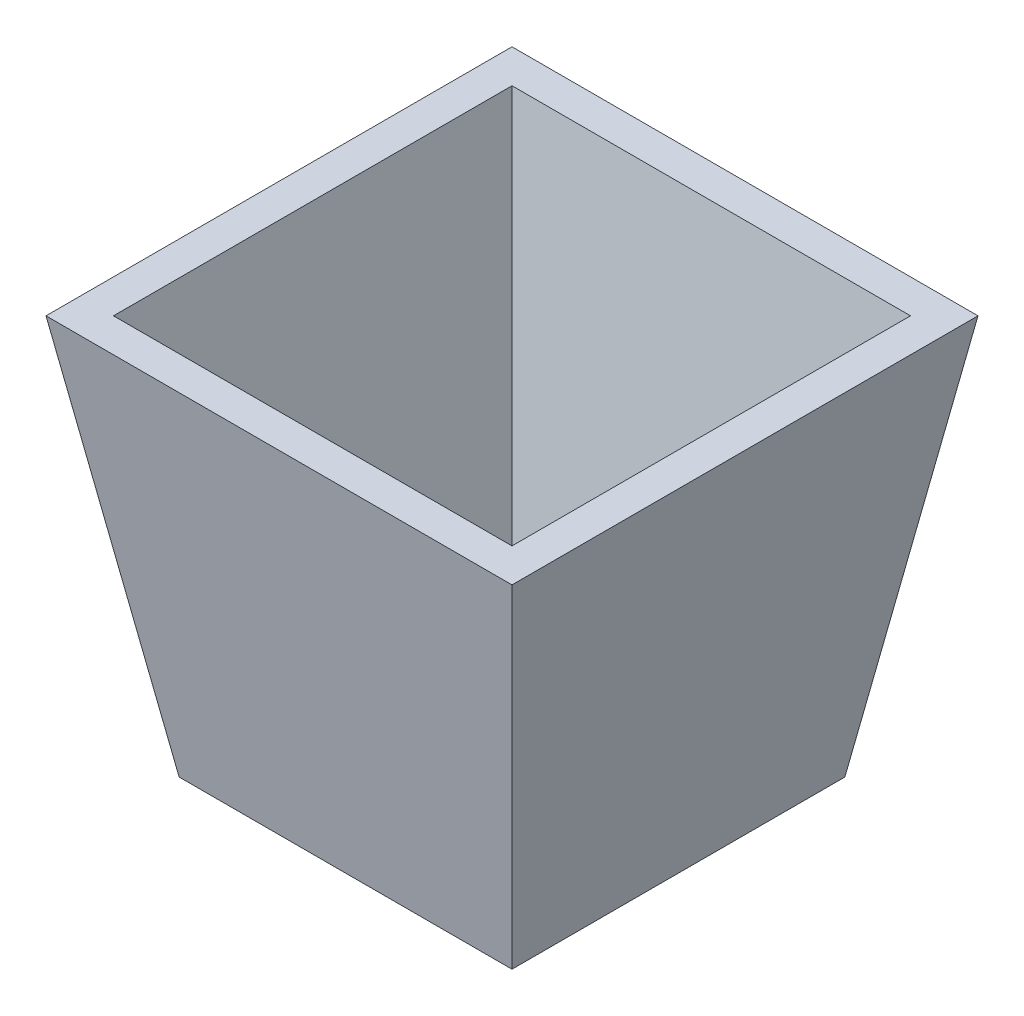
ISO-10303-21;
HEADER;
FILE_DESCRIPTION(('STEP AP214'),'2;1');
FILE_NAME('part.step','',(''),(''),'','','');
FILE_SCHEMA(('AUTOMOTIVE_DESIGN { 1 0 10303 214 1 1 1 1 }'));
ENDSEC;
DATA;
#1=APPLICATION_CONTEXT('core data for automotive mechanical design processes');
#2=APPLICATION_PROTOCOL_DEFINITION('international standard','automotive_design',2000,#1);
#3=PRODUCT_CONTEXT('',#1,'mechanical');
#4=PRODUCT('Part','Part','',(#3));
#5=PRODUCT_RELATED_PRODUCT_CATEGORY('part','',(#4));
#6=PRODUCT_DEFINITION_FORMATION('','',#4);
#7=PRODUCT_DEFINITION_CONTEXT('part definition',#1,'design');
#8=PRODUCT_DEFINITION('design','',#6,#7);
#9=PRODUCT_DEFINITION_SHAPE('','',#8);
#10=(LENGTH_UNIT() NAMED_UNIT(*) SI_UNIT(.MILLI.,.METRE.));
#11=(NAMED_UNIT(*) PLANE_ANGLE_UNIT() SI_UNIT($,.RADIAN.));
#12=(NAMED_UNIT(*) SI_UNIT($,.STERADIAN.) SOLID_ANGLE_UNIT());
#13=UNCERTAINTY_MEASURE_WITH_UNIT(LENGTH_MEASURE(1.E-05),#10,'distance_accuracy_value','');
#14=(GEOMETRIC_REPRESENTATION_CONTEXT(3) GLOBAL_UNCERTAINTY_ASSIGNED_CONTEXT((#13)) GLOBAL_UNIT_ASSIGNED_CONTEXT((#10,
#11,#12)) REPRESENTATION_CONTEXT('',''));
#15=CARTESIAN_POINT('',(0.,0.,0.));
#16=DIRECTION('',(0.,0.,1.));
#17=DIRECTION('',(1.,0.,0.));
#18=AXIS2_PLACEMENT_3D('',#15,#16,#17);
#19=CARTESIAN_POINT('',(0.,0.,0.));
#20=DIRECTION('',(0.,1.,0.));
#21=DIRECTION('',(0.,0.,1.));
#22=AXIS2_PLACEMENT_3D('',#19,#20,#21);
#23=PLANE('',#22);
#24=DIRECTION('',(1.,0.,0.));
#25=VECTOR('',#24,1.);
#26=CARTESIAN_POINT('',(0.,0.,41.5287291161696));
#27=LINE('',#26,#25);
#28=CARTESIAN_POINT('',(-41.5287291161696,0.,41.5287291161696));
#29=VERTEX_POINT('',#28);
#30=CARTESIAN_POINT('',(41.5287291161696,0.,41.5287291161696));
#31=VERTEX_POINT('',#30);
#32=EDGE_CURVE('E131',#29,#31,#27,.T.);
#33=ORIENTED_EDGE('',*,*,#32,.T.);
#34=DIRECTION('',(0.,0.,-1.));
#35=VECTOR('',#34,1.);
#36=CARTESIAN_POINT('',(41.5287291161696,0.,0.));
#37=LINE('',#36,#35);
#38=CARTESIAN_POINT('',(41.5287291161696,0.,-41.5287291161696));
#39=VERTEX_POINT('',#38);
#40=EDGE_CURVE('E157',#31,#39,#37,.T.);
#41=ORIENTED_EDGE('',*,*,#40,.T.);
#42=DIRECTION('',(-1.,0.,0.));
#43=VECTOR('',#42,1.);
#44=CARTESIAN_POINT('',(0.,0.,-41.5287291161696));
#45=LINE('',#44,#43);
#46=CARTESIAN_POINT('',(-41.5287291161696,0.,-41.5287291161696));
#47=VERTEX_POINT('',#46);
#48=EDGE_CURVE('E140',#39,#47,#45,.T.);
#49=ORIENTED_EDGE('',*,*,#48,.T.);
#50=DIRECTION('',(0.,0.,1.));
#51=VECTOR('',#50,1.);
#52=CARTESIAN_POINT('',(-41.5287291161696,0.,0.));
#53=LINE('',#52,#51);
#54=EDGE_CURVE('E141',#47,#29,#53,.T.);
#55=ORIENTED_EDGE('',*,*,#54,.T.);
#56=EDGE_LOOP('',(#33,#41,#49,#55));
#57=FACE_BOUND('',#56,.T.);
#58=DIRECTION('',(0.,0.,-1.));
#59=VECTOR('',#58,1.);
#60=CARTESIAN_POINT('',(50.,0.,-50.));
#61=LINE('',#60,#59);
#62=CARTESIAN_POINT('',(50.,0.,50.));
#63=VERTEX_POINT('',#62);
#64=CARTESIAN_POINT('',(50.,0.,-50.));
#65=VERTEX_POINT('',#64);
#66=EDGE_CURVE('E231',#63,#65,#61,.T.);
#67=ORIENTED_EDGE('',*,*,#66,.F.);
#68=DIRECTION('',(1.,0.,0.));
#69=VECTOR('',#68,1.);
#70=CARTESIAN_POINT('',(-50.,0.,50.));
#71=LINE('',#70,#69);
#72=CARTESIAN_POINT('',(-50.,0.,50.));
#73=VERTEX_POINT('',#72);
#74=EDGE_CURVE('E245',#73,#63,#71,.T.);
#75=ORIENTED_EDGE('',*,*,#74,.F.);
#76=DIRECTION('',(0.,0.,1.));
#77=VECTOR('',#76,1.);
#78=CARTESIAN_POINT('',(-50.,0.,-50.));
#79=LINE('',#78,#77);
#80=CARTESIAN_POINT('',(-50.,0.,-50.));
#81=VERTEX_POINT('',#80);
#82=EDGE_CURVE('E59',#81,#73,#79,.T.);
#83=ORIENTED_EDGE('',*,*,#82,.F.);
#84=DIRECTION('',(-1.,0.,0.));
#85=VECTOR('',#84,1.);
#86=CARTESIAN_POINT('',(-50.,0.,-50.));
#87=LINE('',#86,#85);
#88=EDGE_CURVE('E12',#65,#81,#87,.T.);
#89=ORIENTED_EDGE('',*,*,#88,.F.);
#90=EDGE_LOOP('',(#67,#75,#83,#89));
#91=FACE_BOUND('',#90,.T.);
#92=ADVANCED_FACE('F49',(#57,#91),#23,.F.);
#93=CARTESIAN_POINT('',(0.,120.,0.));
#94=DIRECTION('',(0.,1.,0.));
#95=DIRECTION('',(0.,0.,1.));
#96=AXIS2_PLACEMENT_3D('',#93,#94,#95);
#97=PLANE('',#96);
#98=DIRECTION('',(0.,0.,-1.));
#99=VECTOR('',#98,1.);
#100=CARTESIAN_POINT('',(59.862062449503,120.,0.));
#101=LINE('',#100,#99);
#102=CARTESIAN_POINT('',(59.862062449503,120.,59.862062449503));
#103=VERTEX_POINT('',#102);
#104=CARTESIAN_POINT('',(59.862062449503,120.,-59.862062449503));
#105=VERTEX_POINT('',#104);
#106=EDGE_CURVE('E159',#103,#105,#101,.T.);
#107=ORIENTED_EDGE('',*,*,#106,.F.);
#108=DIRECTION('',(1.,0.,0.));
#109=VECTOR('',#108,1.);
#110=CARTESIAN_POINT('',(0.,120.,59.862062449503));
#111=LINE('',#110,#109);
#112=CARTESIAN_POINT('',(-59.862062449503,120.,59.862062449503));
#113=VERTEX_POINT('',#112);
#114=EDGE_CURVE('E181',#113,#103,#111,.T.);
#115=ORIENTED_EDGE('',*,*,#114,.F.);
#116=DIRECTION('',(0.,0.,1.));
#117=VECTOR('',#116,1.);
#118=CARTESIAN_POINT('',(-59.862062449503,120.,0.));
#119=LINE('',#118,#117);
#120=CARTESIAN_POINT('',(-59.862062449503,120.,-59.862062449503));
#121=VERTEX_POINT('',#120);
#122=EDGE_CURVE('E183',#121,#113,#119,.T.);
#123=ORIENTED_EDGE('',*,*,#122,.F.);
#124=DIRECTION('',(-1.,0.,0.));
#125=VECTOR('',#124,1.);
#126=CARTESIAN_POINT('',(0.,120.,-59.862062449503));
#127=LINE('',#126,#125);
#128=EDGE_CURVE('E173',#105,#121,#127,.T.);
#129=ORIENTED_EDGE('',*,*,#128,.F.);
#130=EDGE_LOOP('',(#107,#115,#123,#129));
#131=FACE_BOUND('',#130,.T.);
#132=DIRECTION('',(0.,0.,-1.));
#133=VECTOR('',#132,1.);
#134=CARTESIAN_POINT('',(70.,120.,-70.));
#135=LINE('',#134,#133);
#136=CARTESIAN_POINT('',(70.,120.,70.));
#137=VERTEX_POINT('',#136);
#138=CARTESIAN_POINT('',(70.,120.,-70.));
#139=VERTEX_POINT('',#138);
#140=EDGE_CURVE('E168',#137,#139,#135,.T.);
#141=ORIENTED_EDGE('',*,*,#140,.T.);
#142=DIRECTION('',(-1.,0.,0.));
#143=VECTOR('',#142,1.);
#144=CARTESIAN_POINT('',(-70.,120.,-70.));
#145=LINE('',#144,#143);
#146=CARTESIAN_POINT('',(-70.,120.,-70.));
#147=VERTEX_POINT('',#146);
#148=EDGE_CURVE('E191',#139,#147,#145,.T.);
#149=ORIENTED_EDGE('',*,*,#148,.T.);
#150=DIRECTION('',(0.,0.,1.));
#151=VECTOR('',#150,1.);
#152=CARTESIAN_POINT('',(-70.,120.,-70.));
#153=LINE('',#152,#151);
#154=CARTESIAN_POINT('',(-70.,120.,70.));
#155=VERTEX_POINT('',#154);
#156=EDGE_CURVE('E283',#147,#155,#153,.T.);
#157=ORIENTED_EDGE('',*,*,#156,.T.);
#158=DIRECTION('',(1.,0.,0.));
#159=VECTOR('',#158,1.);
#160=CARTESIAN_POINT('',(-70.,120.,70.));
#161=LINE('',#160,#159);
#162=EDGE_CURVE('E299',#155,#137,#161,.T.);
#163=ORIENTED_EDGE('',*,*,#162,.T.);
#164=EDGE_LOOP('',(#141,#149,#157,#163));
#165=FACE_BOUND('',#164,.T.);
#166=ADVANCED_FACE('F345',(#131,#165),#97,.T.);
#167=CARTESIAN_POINT('',(48.6486486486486,-8.10810810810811,0.));
#168=DIRECTION('',(0.986393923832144,-0.164398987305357,0.));
#169=DIRECTION('',(0.164398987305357,0.986393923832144,0.));
#170=AXIS2_PLACEMENT_3D('',#167,#168,#169);
#171=PLANE('',#170);
#172=DIRECTION('',(-0.162221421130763,-0.973328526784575,-0.162221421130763));
#173=VECTOR('',#172,1.);
#174=CARTESIAN_POINT('',(70.,120.,70.));
#175=LINE('',#174,#173);
#176=EDGE_CURVE('E302',#137,#63,#175,.T.);
#177=ORIENTED_EDGE('',*,*,#176,.T.);
#178=ORIENTED_EDGE('',*,*,#66,.T.);
#179=DIRECTION('',(-0.162221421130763,-0.973328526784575,0.162221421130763));
#180=VECTOR('',#179,1.);
#181=CARTESIAN_POINT('',(70.,120.,-70.));
#182=LINE('',#181,#180);
#183=EDGE_CURVE('E197',#139,#65,#182,.T.);
#184=ORIENTED_EDGE('',*,*,#183,.F.);
#185=ORIENTED_EDGE('',*,*,#140,.F.);
#186=EDGE_LOOP('',(#177,#178,#184,#185));
#187=FACE_BOUND('',#186,.T.);
#188=ADVANCED_FACE('F210',(#187),#171,.T.);
#189=CARTESIAN_POINT('',(0.,-8.10810810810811,-48.6486486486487));
#190=DIRECTION('',(0.,-0.164398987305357,-0.986393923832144));
#191=DIRECTION('',(0.,0.986393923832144,-0.164398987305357));
#192=AXIS2_PLACEMENT_3D('',#189,#190,#191);
#193=PLANE('',#192);
#194=ORIENTED_EDGE('',*,*,#183,.T.);
#195=ORIENTED_EDGE('',*,*,#88,.T.);
#196=DIRECTION('',(0.162221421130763,-0.973328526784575,0.162221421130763));
#197=VECTOR('',#196,1.);
#198=CARTESIAN_POINT('',(-70.,120.,-70.));
#199=LINE('',#198,#197);
#200=EDGE_CURVE('E288',#147,#81,#199,.T.);
#201=ORIENTED_EDGE('',*,*,#200,.F.);
#202=ORIENTED_EDGE('',*,*,#148,.F.);
#203=EDGE_LOOP('',(#194,#195,#201,#202));
#204=FACE_BOUND('',#203,.T.);
#205=ADVANCED_FACE('F199',(#204),#193,.T.);
#206=CARTESIAN_POINT('',(0.,-8.10810810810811,48.6486486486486));
#207=DIRECTION('',(0.,-0.164398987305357,0.986393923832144));
#208=DIRECTION('',(0.,-0.986393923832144,-0.164398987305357));
#209=AXIS2_PLACEMENT_3D('',#206,#207,#208);
#210=PLANE('',#209);
#211=DIRECTION('',(0.162221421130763,-0.973328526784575,-0.162221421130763));
#212=VECTOR('',#211,1.);
#213=CARTESIAN_POINT('',(-70.,120.,70.));
#214=LINE('',#213,#212);
#215=EDGE_CURVE('E286',#155,#73,#214,.T.);
#216=ORIENTED_EDGE('',*,*,#215,.T.);
#217=ORIENTED_EDGE('',*,*,#74,.T.);
#218=ORIENTED_EDGE('',*,*,#176,.F.);
#219=ORIENTED_EDGE('',*,*,#162,.F.);
#220=EDGE_LOOP('',(#216,#217,#218,#219));
#221=FACE_BOUND('',#220,.T.);
#222=ADVANCED_FACE('F209',(#221),#210,.T.);
#223=CARTESIAN_POINT('',(-48.6486486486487,-8.10810810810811,0.));
#224=DIRECTION('',(-0.986393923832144,-0.164398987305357,0.));
#225=DIRECTION('',(0.164398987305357,-0.986393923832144,0.));
#226=AXIS2_PLACEMENT_3D('',#223,#224,#225);
#227=PLANE('',#226);
#228=ORIENTED_EDGE('',*,*,#200,.T.);
#229=ORIENTED_EDGE('',*,*,#82,.T.);
#230=ORIENTED_EDGE('',*,*,#215,.F.);
#231=ORIENTED_EDGE('',*,*,#156,.F.);
#232=EDGE_LOOP('',(#228,#229,#230,#231));
#233=FACE_BOUND('',#232,.T.);
#234=ADVANCED_FACE('F263',(#233),#227,.T.);
#235=CARTESIAN_POINT('',(38.7847094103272,-6.46411823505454,0.));
#236=DIRECTION('',(0.986393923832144,-0.164398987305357,0.));
#237=DIRECTION('',(0.164398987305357,0.986393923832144,0.));
#238=AXIS2_PLACEMENT_3D('',#235,#236,#237);
#239=PLANE('',#238);
#240=DIRECTION('',(-0.162221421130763,-0.973328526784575,-0.162221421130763));
#241=VECTOR('',#240,1.);
#242=CARTESIAN_POINT('',(37.764059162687,-12.5880197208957,37.764059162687));
#243=LINE('',#242,#241);
#244=CARTESIAN_POINT('',(41.5287291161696,10.,41.5287291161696));
#245=VERTEX_POINT('',#244);
#246=EDGE_CURVE('E169',#103,#245,#243,.T.);
#247=ORIENTED_EDGE('',*,*,#246,.F.);
#248=ORIENTED_EDGE('',*,*,#106,.T.);
#249=DIRECTION('',(-0.162221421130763,-0.973328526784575,0.162221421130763));
#250=VECTOR('',#249,1.);
#251=CARTESIAN_POINT('',(37.764059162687,-12.5880197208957,-37.764059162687));
#252=LINE('',#251,#250);
#253=CARTESIAN_POINT('',(41.5287291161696,9.99999999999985,-41.5287291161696));
#254=VERTEX_POINT('',#253);
#255=EDGE_CURVE('E172',#105,#254,#252,.T.);
#256=ORIENTED_EDGE('',*,*,#255,.T.);
#257=DIRECTION('',(0.,0.,-1.));
#258=VECTOR('',#257,1.);
#259=CARTESIAN_POINT('',(41.5287291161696,10.,0.));
#260=LINE('',#259,#258);
#261=EDGE_CURVE('E160',#245,#254,#260,.T.);
#262=ORIENTED_EDGE('',*,*,#261,.F.);
#263=EDGE_LOOP('',(#247,#248,#256,#262));
#264=FACE_BOUND('',#263,.T.);
#265=ADVANCED_FACE('F271',(#264),#239,.F.);
#266=CARTESIAN_POINT('',(0.,-6.46411823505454,-38.7847094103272));
#267=DIRECTION('',(0.,-0.164398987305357,-0.986393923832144));
#268=DIRECTION('',(0.,0.986393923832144,-0.164398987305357));
#269=AXIS2_PLACEMENT_3D('',#266,#267,#268);
#270=PLANE('',#269);
#271=ORIENTED_EDGE('',*,*,#255,.F.);
#272=ORIENTED_EDGE('',*,*,#128,.T.);
#273=DIRECTION('',(0.162221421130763,-0.973328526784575,0.162221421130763));
#274=VECTOR('',#273,1.);
#275=CARTESIAN_POINT('',(-37.764059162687,-12.5880197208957,-37.764059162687));
#276=LINE('',#275,#274);
#277=CARTESIAN_POINT('',(-41.5287291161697,10.,-41.5287291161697));
#278=VERTEX_POINT('',#277);
#279=EDGE_CURVE('E163',#121,#278,#276,.T.);
#280=ORIENTED_EDGE('',*,*,#279,.T.);
#281=DIRECTION('',(-1.,0.,0.));
#282=VECTOR('',#281,1.);
#283=CARTESIAN_POINT('',(0.,10.,-41.5287291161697));
#284=LINE('',#283,#282);
#285=EDGE_CURVE('E166',#254,#278,#284,.T.);
#286=ORIENTED_EDGE('',*,*,#285,.F.);
#287=EDGE_LOOP('',(#271,#272,#280,#286));
#288=FACE_BOUND('',#287,.T.);
#289=ADVANCED_FACE('F362',(#288),#270,.F.);
#290=CARTESIAN_POINT('',(0.,-6.46411823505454,38.7847094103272));
#291=DIRECTION('',(0.,-0.164398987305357,0.986393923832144));
#292=DIRECTION('',(0.,-0.986393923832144,-0.164398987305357));
#293=AXIS2_PLACEMENT_3D('',#290,#291,#292);
#294=PLANE('',#293);
#295=DIRECTION('',(0.162221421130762,-0.973328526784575,-0.162221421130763));
#296=VECTOR('',#295,1.);
#297=CARTESIAN_POINT('',(-37.764059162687,-12.5880197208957,37.764059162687));
#298=LINE('',#297,#296);
#299=CARTESIAN_POINT('',(-41.5287291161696,9.99999999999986,41.5287291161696));
#300=VERTEX_POINT('',#299);
#301=EDGE_CURVE('E75',#113,#300,#298,.T.);
#302=ORIENTED_EDGE('',*,*,#301,.F.);
#303=ORIENTED_EDGE('',*,*,#114,.T.);
#304=ORIENTED_EDGE('',*,*,#246,.T.);
#305=DIRECTION('',(1.,0.,0.));
#306=VECTOR('',#305,1.);
#307=CARTESIAN_POINT('',(0.,10.,41.5287291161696));
#308=LINE('',#307,#306);
#309=EDGE_CURVE('E162',#300,#245,#308,.T.);
#310=ORIENTED_EDGE('',*,*,#309,.F.);
#311=EDGE_LOOP('',(#302,#303,#304,#310));
#312=FACE_BOUND('',#311,.T.);
#313=ADVANCED_FACE('F372',(#312),#294,.F.);
#314=CARTESIAN_POINT('',(-38.7847094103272,-6.46411823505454,0.));
#315=DIRECTION('',(-0.986393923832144,-0.164398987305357,0.));
#316=DIRECTION('',(0.164398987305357,-0.986393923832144,0.));
#317=AXIS2_PLACEMENT_3D('',#314,#315,#316);
#318=PLANE('',#317);
#319=ORIENTED_EDGE('',*,*,#279,.F.);
#320=ORIENTED_EDGE('',*,*,#122,.T.);
#321=ORIENTED_EDGE('',*,*,#301,.T.);
#322=DIRECTION('',(0.,0.,1.));
#323=VECTOR('',#322,1.);
#324=CARTESIAN_POINT('',(-41.5287291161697,10.,0.));
#325=LINE('',#324,#323);
#326=EDGE_CURVE('E147',#278,#300,#325,.T.);
#327=ORIENTED_EDGE('',*,*,#326,.F.);
#328=EDGE_LOOP('',(#319,#320,#321,#327));
#329=FACE_BOUND('',#328,.T.);
#330=ADVANCED_FACE('F381',(#329),#318,.F.);
#331=CARTESIAN_POINT('',(41.5287291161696,-9.99999999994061E-05,-41.5287291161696));
#332=DIRECTION('',(1.,0.,0.));
#333=DIRECTION('',(0.,0.,-1.));
#334=AXIS2_PLACEMENT_3D('',#331,#332,#333);
#335=PLANE('',#334);
#336=DIRECTION('',(0.,1.,0.));
#337=VECTOR('',#336,1.);
#338=CARTESIAN_POINT('',(41.5287291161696,-9.99999999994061E-05,41.5287291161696));
#339=LINE('',#338,#337);
#340=EDGE_CURVE('E136',#31,#245,#339,.T.);
#341=ORIENTED_EDGE('',*,*,#340,.T.);
#342=ORIENTED_EDGE('',*,*,#261,.T.);
#343=DIRECTION('',(0.,1.,0.));
#344=VECTOR('',#343,1.);
#345=CARTESIAN_POINT('',(41.5287291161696,-9.99999999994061E-05,-41.5287291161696));
#346=LINE('',#345,#344);
#347=EDGE_CURVE('E153',#39,#254,#346,.T.);
#348=ORIENTED_EDGE('',*,*,#347,.F.);
#349=ORIENTED_EDGE('',*,*,#40,.F.);
#350=EDGE_LOOP('',(#341,#342,#348,#349));
#351=FACE_BOUND('',#350,.T.);
#352=ADVANCED_FACE('F389',(#351),#335,.F.);
#353=CARTESIAN_POINT('',(-41.5287291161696,-9.99999999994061E-05,-41.5287291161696));
#354=DIRECTION('',(0.,0.,-1.));
#355=DIRECTION('',(-1.,0.,0.));
#356=AXIS2_PLACEMENT_3D('',#353,#354,#355);
#357=PLANE('',#356);
#358=ORIENTED_EDGE('',*,*,#347,.T.);
#359=ORIENTED_EDGE('',*,*,#285,.T.);
#360=DIRECTION('',(0.,1.,0.));
#361=VECTOR('',#360,1.);
#362=CARTESIAN_POINT('',(-41.5287291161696,-9.99999999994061E-05,-41.5287291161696));
#363=LINE('',#362,#361);
#364=EDGE_CURVE('E67',#47,#278,#363,.T.);
#365=ORIENTED_EDGE('',*,*,#364,.F.);
#366=ORIENTED_EDGE('',*,*,#48,.F.);
#367=EDGE_LOOP('',(#358,#359,#365,#366));
#368=FACE_BOUND('',#367,.T.);
#369=ADVANCED_FACE('F398',(#368),#357,.F.);
#370=CARTESIAN_POINT('',(-41.5287291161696,-9.99999999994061E-05,41.5287291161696));
#371=DIRECTION('',(0.,0.,1.));
#372=DIRECTION('',(1.,0.,0.));
#373=AXIS2_PLACEMENT_3D('',#370,#371,#372);
#374=PLANE('',#373);
#375=DIRECTION('',(0.,1.,0.));
#376=VECTOR('',#375,1.);
#377=CARTESIAN_POINT('',(-41.5287291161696,-9.99999999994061E-05,41.5287291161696));
#378=LINE('',#377,#376);
#379=EDGE_CURVE('E134',#29,#300,#378,.T.);
#380=ORIENTED_EDGE('',*,*,#379,.T.);
#381=ORIENTED_EDGE('',*,*,#309,.T.);
#382=ORIENTED_EDGE('',*,*,#340,.F.);
#383=ORIENTED_EDGE('',*,*,#32,.F.);
#384=EDGE_LOOP('',(#380,#381,#382,#383));
#385=FACE_BOUND('',#384,.T.);
#386=ADVANCED_FACE('F133',(#385),#374,.F.);
#387=CARTESIAN_POINT('',(-41.5287291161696,-9.99999999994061E-05,-41.5287291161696));
#388=DIRECTION('',(-1.,0.,0.));
#389=DIRECTION('',(0.,0.,1.));
#390=AXIS2_PLACEMENT_3D('',#387,#388,#389);
#391=PLANE('',#390);
#392=ORIENTED_EDGE('',*,*,#364,.T.);
#393=ORIENTED_EDGE('',*,*,#326,.T.);
#394=ORIENTED_EDGE('',*,*,#379,.F.);
#395=ORIENTED_EDGE('',*,*,#54,.F.);
#396=EDGE_LOOP('',(#392,#393,#394,#395));
#397=FACE_BOUND('',#396,.T.);
#398=ADVANCED_FACE('F144',(#397),#391,.F.);
#399=CLOSED_SHELL('',(#92,#166,#188,#205,#222,#234,#265,#289,#313,#330,#352,#369,#386,#398));
#400=MANIFOLD_SOLID_BREP('B2',#399);
#401=ADVANCED_BREP_SHAPE_REPRESENTATION('',(#18,#400),#14);
#402=SHAPE_DEFINITION_REPRESENTATION(#9,#401);
ENDSEC;
END-ISO-10303-21;
